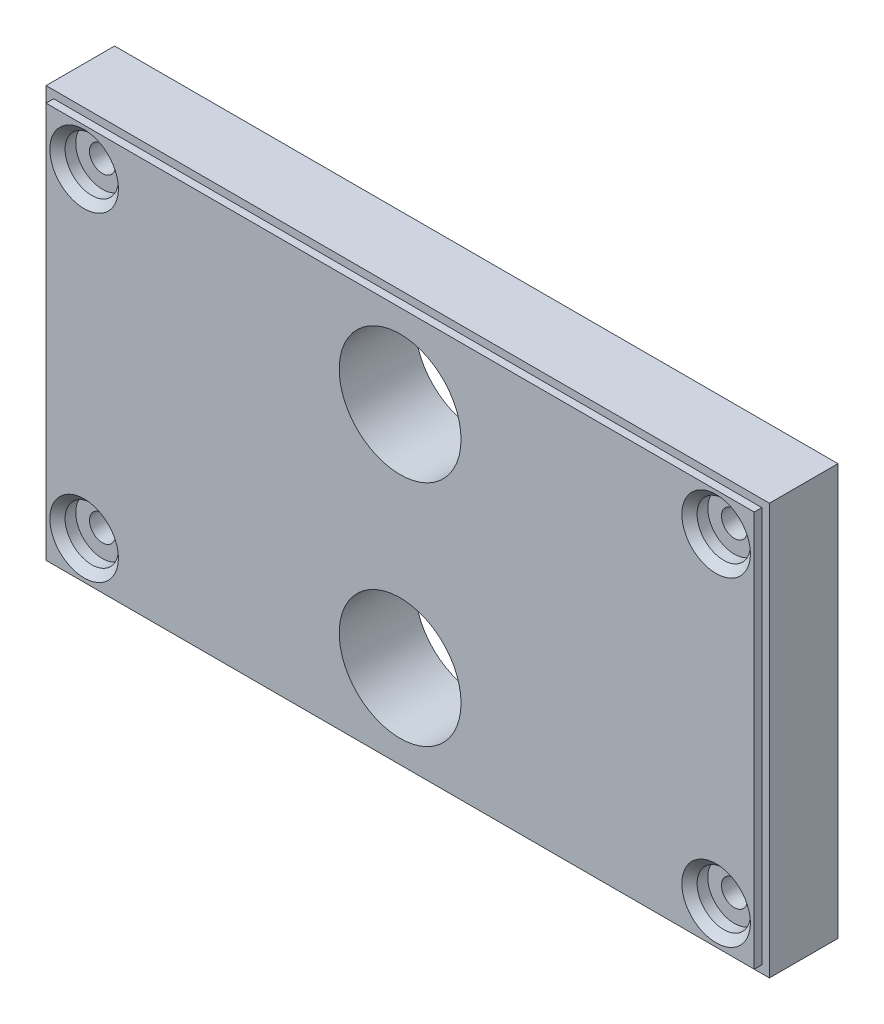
from build123d import *

# Parameters (mm, degrees)
SKETCH1_W                                = 95
SKETCH1_H                                = 54
BOSS_EXTRUDE1_DEPTH                      = 10
SKETCH2_W                                = 95
SKETCH2_H                                = 54
SKETCH2_W_2                              = 93
SKETCH2_H_2                              = 52
CUT_EXTRUDE1_DEPTH                       = 1
CBORE_FOR_M3_PAN_HEAD_SCREW1_D           = 3.4
CBORE_FOR_M3_PAN_HEAD_SCREW1_CBORE_D     = 7
CBORE_FOR_M3_PAN_HEAD_SCREW1_CBORE_DEPTH = 2.4
CHAMFER1_SIZE                            = 1
SKETCH4_R                                = 8
CUT_EXTRUDE2_DEPTH                       = 10


with BuildPart() as part:
    # Sketch1 → Boss-Extrude1 (new body)
    with BuildSketch(Plane.XY):
        with Locations((-407.351708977, 0)):
            Rectangle(SKETCH1_W, SKETCH1_H)
    extrude(amount=BOSS_EXTRUDE1_DEPTH)

    # Sketch2 → Cut-Extrude1 (cut)
    with BuildSketch(Plane.XY.offset(10)):
        with Locations((-407.351708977, 0)):
            Rectangle(SKETCH2_W, SKETCH2_H)
        with Locations((-407.351708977, 0)):
            Rectangle(SKETCH2_W_2, SKETCH2_H_2, mode=Mode.SUBTRACT)
    extrude(amount=-CUT_EXTRUDE1_DEPTH, mode=Mode.SUBTRACT)

    # CBORE for M3 Pan Head Screw1 (through all)
    with Locations(Plane(origin=(-448.851708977, 21, 10), x_dir=(1, 0, 0), z_dir=(0, 0, 1))):
        with Locations((0, 0), (83, 0), (83, -42), (0, -42)):
            CounterBoreHole(CBORE_FOR_M3_PAN_HEAD_SCREW1_D / 2, CBORE_FOR_M3_PAN_HEAD_SCREW1_CBORE_D / 2, CBORE_FOR_M3_PAN_HEAD_SCREW1_CBORE_DEPTH)

    # Chamfer1
    chamfer1_edges = [part.edges().sort_by_distance(p)[0] for p in [
        (-452.351708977, -21, 10),
        (-369.351708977, -21, 10),
        (-369.351708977, 21, 10),
        (-452.351708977, 21, 10),
    ]]
    chamfer(chamfer1_edges, length=CHAMFER1_SIZE)

    # Sketch4 → Cut-Extrude2 (cut)
    with BuildSketch(Plane.XY.offset(10)):
        with Locations((-407.351708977, 15)):
            Circle(SKETCH4_R)
        with Locations((-407.351708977, -15)):
            Circle(SKETCH4_R)
    extrude(amount=-CUT_EXTRUDE2_DEPTH, mode=Mode.SUBTRACT)


solid = part.part
